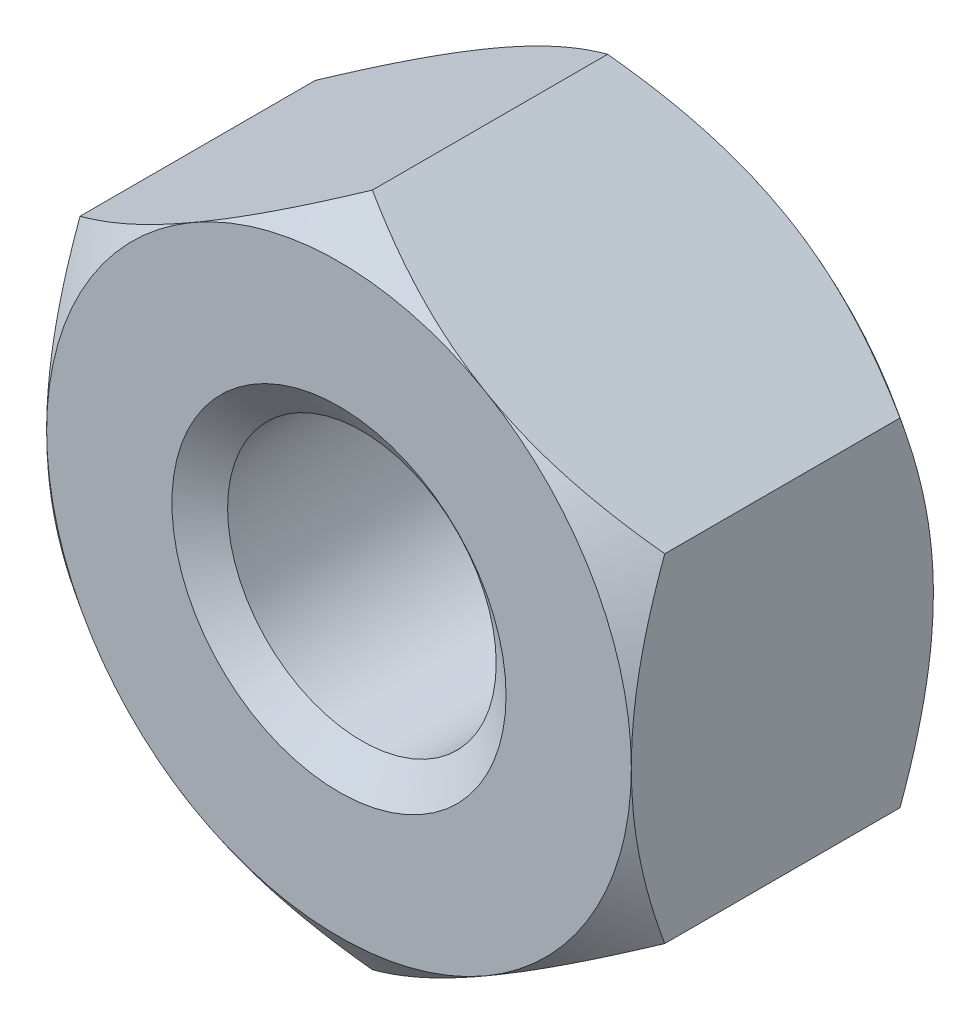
from build123d import *

# Parameters (mm, degrees)
BASENUTSKE_R  = 2.5527
BASENUT_DEPTH = 5.7404


with BuildPart() as part:
    # BaseNutSke → BaseNut (new body)
    with BuildSketch(Plane.XY):
        Polygon((5.55625, 3.207902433), (5.55625, -3.207902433), (0, -6.415804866), (-5.55625, -3.207902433), (-5.55625, 3.207902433), (0, 6.415804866), align=None)
        Circle(BASENUTSKE_R, mode=Mode.SUBTRACT)
    extrude(amount=-BASENUT_DEPTH)

    # Sketch3 → Double-Chamfer (revolve, cut)
    with BuildSketch(Plane(origin=(0, 0, 0), x_dir=(0, 0, -1), z_dir=(1, 0, 0))):
        Polygon((5.7404, 5.55625), (5.1054, 6.415804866), (5.1054, 19.115804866), (18.4404, 19.115804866), (18.4404, 5.55625), align=None)
        Polygon((0.635, 19.115804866), (-12.7, 19.115804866), (-12.7, 5.55625), (0, 5.55625), (0.635, 6.415804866), align=None)
    revolve(axis=Axis((0, 0, 0), (0, 0, -1)), mode=Mode.SUBTRACT)

    # Sketch5 (on Right Plane) → EndChamfer (revolve, cut)
    with BuildSketch(Plane(origin=(0, 0, 0), x_dir=(0, 0, -1), z_dir=(1, 0, 0)), mode=Mode.PRIVATE) as endchamfer_sk:
        Polygon((5.715, 3.175), (5.235686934, 2.49047), (5.7658, 2.49047), (5.7658, 3.175), align=None)
        Polygon((-0.0508, 3.175), (0, 3.175), (0.479313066, 2.49047), (-0.0508, 2.49047), align=None)
    revolve(endchamfer_sk.sketch.rotate(Axis((0, 0, -25.037505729), (0, 0, -1)), 90), axis=Axis((0, 0, -25.037505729), (0, 0, -1)), mode=Mode.SUBTRACT)


solid = part.part
